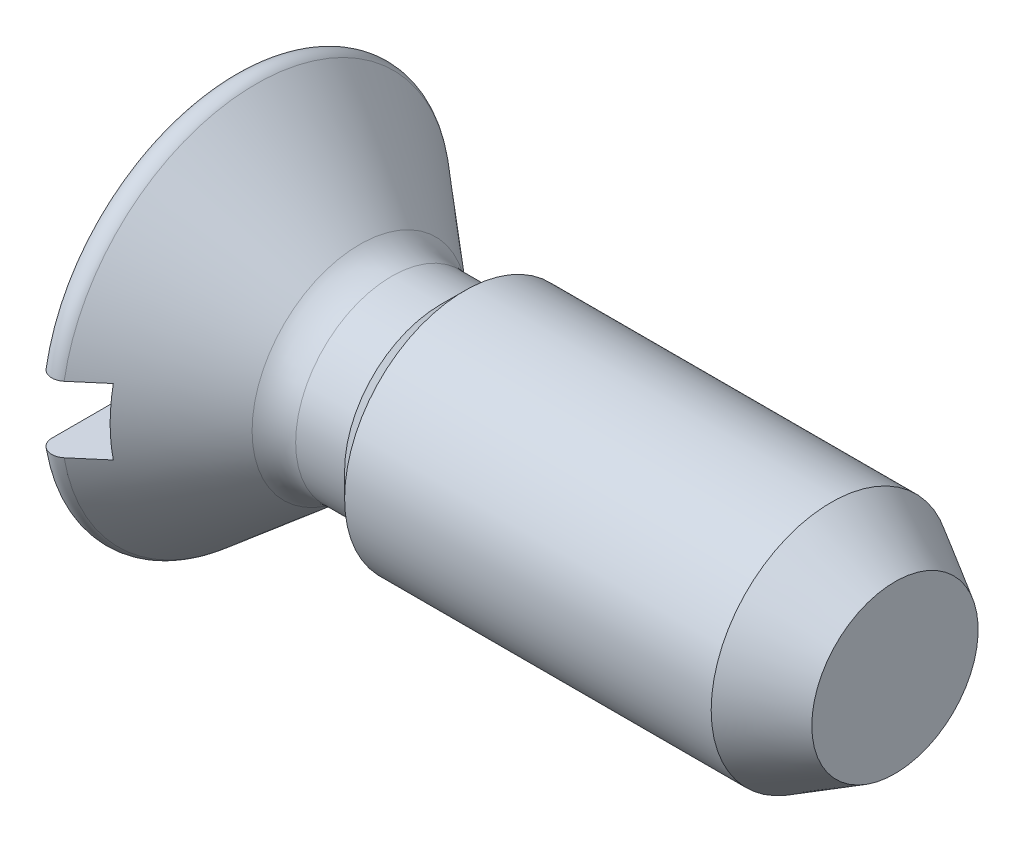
from build123d import *

# Parameters (mm, degrees)
SLOT_CUT_EXTRUDE1_DEPTH      = 9.685758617
SLOT_CUT_EXTRUDE1_DEPTH_BACK = 9.685758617
SKETCH2_W                    = 0.6
SKETCH2_H                    = 0.8


with BuildPart() as part:
    # Sketch1 → base-Revolve (revolve)
    with BuildSketch(Plane.XY, mode=Mode.PRIVATE) as base_revolve_sk:
        with BuildLine():
            Line((0, 0), (0, 2.221903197))
            ThreePointArc((0, 2.221903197), (0.098154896, 2.37597552), (0.279273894, 2.352130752))
            Line((0.279273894, 2.352130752), (1.532709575, 1.300373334))
            ThreePointArc((1.532709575, 1.300373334), (1.713170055, 1.196184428), (1.918382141, 1.16))
            Line((1.918382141, 1.16), (2.51, 1.16))
            Line((2.51, 1.16), (2.8, 1.45))
            Line((2.8, 1.45), (8, 1.45))
            Line((8, 1.45), (8, 0))
            Line((8, 0), (0, 0))
        make_face()
    revolve(base_revolve_sk.sketch.rotate(Axis((0, 0, 0), (1, 0, 0)), 90), axis=Axis((0, 0, 0), (1, 0, 0)))

    # Sketch2 → slot_Cut-Extrude1 (cut, two sides: drawn at the far end of the back side and taken through both)
    with BuildSketch(Plane.XY.offset(-SLOT_CUT_EXTRUDE1_DEPTH_BACK)):
        with Locations((0.3, 0)):
            Rectangle(SKETCH2_W, SKETCH2_H)
    extrude(amount=SLOT_CUT_EXTRUDE1_DEPTH + SLOT_CUT_EXTRUDE1_DEPTH_BACK, mode=Mode.SUBTRACT)

    # Sketch8 → point_Cut-Revolve1 (revolve, cut)
    with BuildSketch(Plane.XY, mode=Mode.PRIVATE) as point_cut_revolve1_sk:
        Polygon((8, 0), (8.508, 0), (8.508, 1.958), (7.229237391, 1.958), (7.229237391, 1.45), (8, 1.005), align=None)
    revolve(point_cut_revolve1_sk.sketch.rotate(Axis((0, 0, 0), (1, 0, 0)), 90), axis=Axis((0, 0, 0), (1, 0, 0)), mode=Mode.SUBTRACT)


solid = part.part
